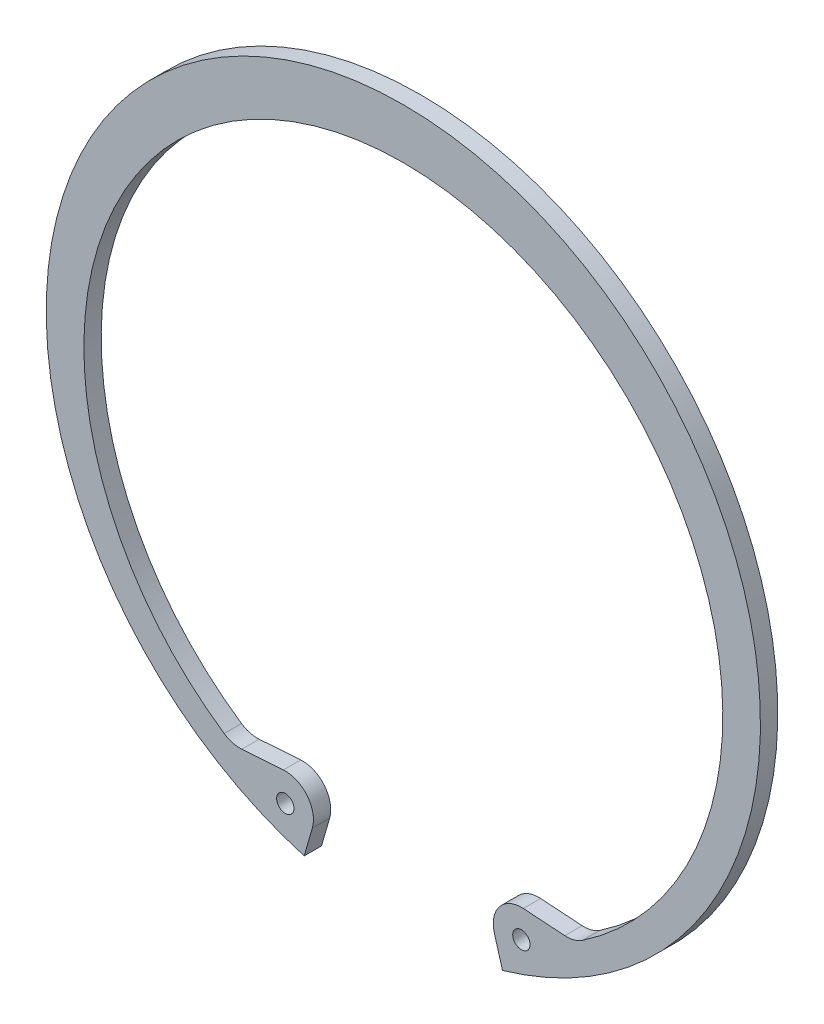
ISO-10303-21;
HEADER;
FILE_DESCRIPTION(('STEP AP214'),'2;1');
FILE_NAME('part.step','',(''),(''),'','','');
FILE_SCHEMA(('AUTOMOTIVE_DESIGN { 1 0 10303 214 1 1 1 1 }'));
ENDSEC;
DATA;
#1=APPLICATION_CONTEXT('core data for automotive mechanical design processes');
#2=APPLICATION_PROTOCOL_DEFINITION('international standard','automotive_design',2000,#1);
#3=PRODUCT_CONTEXT('',#1,'mechanical');
#4=PRODUCT('Part','Part','',(#3));
#5=PRODUCT_RELATED_PRODUCT_CATEGORY('part','',(#4));
#6=PRODUCT_DEFINITION_FORMATION('','',#4);
#7=PRODUCT_DEFINITION_CONTEXT('part definition',#1,'design');
#8=PRODUCT_DEFINITION('design','',#6,#7);
#9=PRODUCT_DEFINITION_SHAPE('','',#8);
#10=(LENGTH_UNIT() NAMED_UNIT(*) SI_UNIT(.MILLI.,.METRE.));
#11=(NAMED_UNIT(*) PLANE_ANGLE_UNIT() SI_UNIT($,.RADIAN.));
#12=(NAMED_UNIT(*) SI_UNIT($,.STERADIAN.) SOLID_ANGLE_UNIT());
#13=UNCERTAINTY_MEASURE_WITH_UNIT(LENGTH_MEASURE(1.E-05),#10,'distance_accuracy_value','');
#14=(GEOMETRIC_REPRESENTATION_CONTEXT(3) GLOBAL_UNCERTAINTY_ASSIGNED_CONTEXT((#13)) GLOBAL_UNIT_ASSIGNED_CONTEXT((#10,
#11,#12)) REPRESENTATION_CONTEXT('',''));
#15=CARTESIAN_POINT('',(0.,0.,0.));
#16=DIRECTION('',(0.,0.,1.));
#17=DIRECTION('',(1.,0.,0.));
#18=AXIS2_PLACEMENT_3D('',#15,#16,#17);
#19=CARTESIAN_POINT('',(0.,0.,4.));
#20=DIRECTION('',(0.,0.,1.));
#21=DIRECTION('',(1.,0.,0.));
#22=AXIS2_PLACEMENT_3D('',#19,#20,#21);
#23=PLANE('',#22);
#24=CARTESIAN_POINT('',(27.2700191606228,-70.939030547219,4.));
#25=DIRECTION('',(0.,0.,1.));
#26=DIRECTION('',(1.,0.,0.));
#27=AXIS2_PLACEMENT_3D('',#24,#25,#26);
#28=CIRCLE('',#27,2.);
#29=CARTESIAN_POINT('',(29.2700191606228,-70.939030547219,4.));
#30=VERTEX_POINT('',#29);
#31=EDGE_CURVE('E127',#30,#30,#28,.T.);
#32=ORIENTED_EDGE('',*,*,#31,.F.);
#33=EDGE_LOOP('',(#32));
#34=FACE_BOUND('',#33,.T.);
#35=CARTESIAN_POINT('',(0.,0.,4.));
#36=DIRECTION('',(0.,0.,1.));
#37=DIRECTION('',(1.,0.,0.));
#38=AXIS2_PLACEMENT_3D('',#35,#36,#37);
#39=CIRCLE('',#38,82.5);
#40=CARTESIAN_POINT('',(22.907802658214,-79.255804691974,4.));
#41=VERTEX_POINT('',#40);
#42=CARTESIAN_POINT('',(-22.907802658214,-79.255804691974,4.));
#43=VERTEX_POINT('',#42);
#44=EDGE_CURVE('E149',#41,#43,#39,.T.);
#45=ORIENTED_EDGE('',*,*,#44,.T.);
#46=DIRECTION('',(0.277670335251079,0.960676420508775,0.));
#47=VECTOR('',#46,1.);
#48=CARTESIAN_POINT('',(-21.0256224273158,-72.743887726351,4.));
#49=LINE('',#48,#47);
#50=CARTESIAN_POINT('',(-21.0256224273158,-72.743887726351,4.));
#51=VERTEX_POINT('',#50);
#52=EDGE_CURVE('E122',#43,#51,#49,.T.);
#53=ORIENTED_EDGE('',*,*,#52,.T.);
#54=CARTESIAN_POINT('',(-27.2700191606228,-70.939030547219,4.));
#55=DIRECTION('',(0.,0.,1.));
#56=DIRECTION('',(-1.,0.,0.));
#57=AXIS2_PLACEMENT_3D('',#54,#55,#56);
#58=CIRCLE('',#57,6.49999999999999);
#59=CARTESIAN_POINT('',(-27.709717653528,-64.4539195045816,4.));
#60=VERTEX_POINT('',#59);
#61=EDGE_CURVE('E152',#51,#60,#58,.T.);
#62=ORIENTED_EDGE('',*,*,#61,.T.);
#63=DIRECTION('',(-0.997709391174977,-0.0676459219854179,0.));
#64=VECTOR('',#63,1.);
#65=CARTESIAN_POINT('',(-37.3047397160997,-65.104473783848,4.));
#66=LINE('',#65,#64);
#67=CARTESIAN_POINT('',(-37.3047397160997,-65.104473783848,4.));
#68=VERTEX_POINT('',#67);
#69=EDGE_CURVE('E154',#60,#68,#66,.T.);
#70=ORIENTED_EDGE('',*,*,#69,.T.);
#71=CARTESIAN_POINT('',(-37.7444382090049,-58.6193627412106,4.));
#72=DIRECTION('',(0.,0.,-1.));
#73=DIRECTION('',(-1.,0.,0.));
#74=AXIS2_PLACEMENT_3D('',#71,#72,#73);
#75=CIRCLE('',#74,6.49999999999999);
#76=CARTESIAN_POINT('',(-41.3898891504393,-64.0008762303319,4.));
#77=VERTEX_POINT('',#76);
#78=EDGE_CURVE('E156',#68,#77,#75,.T.);
#79=ORIENTED_EDGE('',*,*,#78,.T.);
#80=CARTESIAN_POINT('',(0.,-2.9,4.));
#81=DIRECTION('',(0.,0.,-1.));
#82=DIRECTION('',(1.,0.,0.));
#83=AXIS2_PLACEMENT_3D('',#80,#81,#82);
#84=CIRCLE('',#83,73.8);
#85=CARTESIAN_POINT('',(41.3898891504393,-64.000876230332,4.));
#86=VERTEX_POINT('',#85);
#87=EDGE_CURVE('E158',#77,#86,#84,.T.);
#88=ORIENTED_EDGE('',*,*,#87,.T.);
#89=CARTESIAN_POINT('',(37.7444382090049,-58.6193627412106,4.));
#90=DIRECTION('',(0.,0.,-1.));
#91=DIRECTION('',(1.,0.,0.));
#92=AXIS2_PLACEMENT_3D('',#89,#90,#91);
#93=CIRCLE('',#92,6.49999999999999);
#94=CARTESIAN_POINT('',(37.3047397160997,-65.104473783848,4.));
#95=VERTEX_POINT('',#94);
#96=EDGE_CURVE('E160',#86,#95,#93,.T.);
#97=ORIENTED_EDGE('',*,*,#96,.T.);
#98=DIRECTION('',(-0.997709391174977,0.0676459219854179,0.));
#99=VECTOR('',#98,1.);
#100=CARTESIAN_POINT('',(37.3047397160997,-65.104473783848,4.));
#101=LINE('',#100,#99);
#102=CARTESIAN_POINT('',(27.709717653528,-64.4539195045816,4.));
#103=VERTEX_POINT('',#102);
#104=EDGE_CURVE('E162',#95,#103,#101,.T.);
#105=ORIENTED_EDGE('',*,*,#104,.T.);
#106=CARTESIAN_POINT('',(27.2700191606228,-70.939030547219,4.));
#107=DIRECTION('',(0.,0.,1.));
#108=DIRECTION('',(1.,0.,0.));
#109=AXIS2_PLACEMENT_3D('',#106,#107,#108);
#110=CIRCLE('',#109,6.49999999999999);
#111=CARTESIAN_POINT('',(21.0256224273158,-72.743887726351,4.));
#112=VERTEX_POINT('',#111);
#113=EDGE_CURVE('E51',#103,#112,#110,.T.);
#114=ORIENTED_EDGE('',*,*,#113,.T.);
#115=DIRECTION('',(0.277670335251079,-0.960676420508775,0.));
#116=VECTOR('',#115,1.);
#117=CARTESIAN_POINT('',(21.0256224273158,-72.743887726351,4.));
#118=LINE('',#117,#116);
#119=EDGE_CURVE('E46',#112,#41,#118,.T.);
#120=ORIENTED_EDGE('',*,*,#119,.T.);
#121=EDGE_LOOP('',(#45,#53,#62,#70,#79,#88,#97,#105,#114,#120));
#122=FACE_BOUND('',#121,.T.);
#123=CARTESIAN_POINT('',(-27.2700191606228,-70.939030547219,4.));
#124=DIRECTION('',(0.,0.,1.));
#125=DIRECTION('',(-1.,0.,0.));
#126=AXIS2_PLACEMENT_3D('',#123,#124,#125);
#127=CIRCLE('',#126,2.);
#128=CARTESIAN_POINT('',(-29.2700191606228,-70.939030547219,4.));
#129=VERTEX_POINT('',#128);
#130=EDGE_CURVE('E249',#129,#129,#127,.T.);
#131=ORIENTED_EDGE('',*,*,#130,.F.);
#132=EDGE_LOOP('',(#131));
#133=FACE_BOUND('',#132,.T.);
#134=ADVANCED_FACE('F31',(#34,#122,#133),#23,.T.);
#135=CARTESIAN_POINT('',(0.,0.,0.));
#136=DIRECTION('',(0.,0.,1.));
#137=DIRECTION('',(1.,0.,0.));
#138=AXIS2_PLACEMENT_3D('',#135,#136,#137);
#139=PLANE('',#138);
#140=CARTESIAN_POINT('',(27.2700191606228,-70.939030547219,0.));
#141=DIRECTION('',(0.,0.,1.));
#142=DIRECTION('',(1.,0.,0.));
#143=AXIS2_PLACEMENT_3D('',#140,#141,#142);
#144=CIRCLE('',#143,2.);
#145=CARTESIAN_POINT('',(29.2700191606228,-70.939030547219,0.));
#146=VERTEX_POINT('',#145);
#147=EDGE_CURVE('E130',#146,#146,#144,.T.);
#148=ORIENTED_EDGE('',*,*,#147,.T.);
#149=EDGE_LOOP('',(#148));
#150=FACE_BOUND('',#149,.T.);
#151=CARTESIAN_POINT('',(0.,0.,0.));
#152=DIRECTION('',(0.,0.,1.));
#153=DIRECTION('',(1.,0.,0.));
#154=AXIS2_PLACEMENT_3D('',#151,#152,#153);
#155=CIRCLE('',#154,82.5);
#156=CARTESIAN_POINT('',(22.907802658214,-79.255804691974,0.));
#157=VERTEX_POINT('',#156);
#158=CARTESIAN_POINT('',(-22.907802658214,-79.255804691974,0.));
#159=VERTEX_POINT('',#158);
#160=EDGE_CURVE('E113',#157,#159,#155,.T.);
#161=ORIENTED_EDGE('',*,*,#160,.F.);
#162=DIRECTION('',(0.277670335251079,-0.960676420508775,0.));
#163=VECTOR('',#162,1.);
#164=CARTESIAN_POINT('',(21.0256224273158,-72.743887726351,0.));
#165=LINE('',#164,#163);
#166=CARTESIAN_POINT('',(21.0256224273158,-72.743887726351,0.));
#167=VERTEX_POINT('',#166);
#168=EDGE_CURVE('E147',#167,#157,#165,.T.);
#169=ORIENTED_EDGE('',*,*,#168,.F.);
#170=CARTESIAN_POINT('',(27.2700191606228,-70.939030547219,0.));
#171=DIRECTION('',(0.,0.,1.));
#172=DIRECTION('',(1.,0.,0.));
#173=AXIS2_PLACEMENT_3D('',#170,#171,#172);
#174=CIRCLE('',#173,6.49999999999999);
#175=CARTESIAN_POINT('',(27.709717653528,-64.4539195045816,0.));
#176=VERTEX_POINT('',#175);
#177=EDGE_CURVE('E145',#176,#167,#174,.T.);
#178=ORIENTED_EDGE('',*,*,#177,.F.);
#179=DIRECTION('',(-0.997709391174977,0.0676459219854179,0.));
#180=VECTOR('',#179,1.);
#181=CARTESIAN_POINT('',(37.3047397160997,-65.104473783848,0.));
#182=LINE('',#181,#180);
#183=CARTESIAN_POINT('',(37.3047397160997,-65.104473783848,0.));
#184=VERTEX_POINT('',#183);
#185=EDGE_CURVE('E143',#184,#176,#182,.T.);
#186=ORIENTED_EDGE('',*,*,#185,.F.);
#187=CARTESIAN_POINT('',(37.7444382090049,-58.6193627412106,0.));
#188=DIRECTION('',(0.,0.,-1.));
#189=DIRECTION('',(1.,0.,0.));
#190=AXIS2_PLACEMENT_3D('',#187,#188,#189);
#191=CIRCLE('',#190,6.49999999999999);
#192=CARTESIAN_POINT('',(41.3898891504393,-64.000876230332,0.));
#193=VERTEX_POINT('',#192);
#194=EDGE_CURVE('E141',#193,#184,#191,.T.);
#195=ORIENTED_EDGE('',*,*,#194,.F.);
#196=CARTESIAN_POINT('',(0.,-2.9,0.));
#197=DIRECTION('',(0.,0.,-1.));
#198=DIRECTION('',(1.,0.,0.));
#199=AXIS2_PLACEMENT_3D('',#196,#197,#198);
#200=CIRCLE('',#199,73.8);
#201=CARTESIAN_POINT('',(-41.3898891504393,-64.0008762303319,0.));
#202=VERTEX_POINT('',#201);
#203=EDGE_CURVE('E139',#202,#193,#200,.T.);
#204=ORIENTED_EDGE('',*,*,#203,.F.);
#205=CARTESIAN_POINT('',(-37.7444382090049,-58.6193627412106,0.));
#206=DIRECTION('',(0.,0.,-1.));
#207=DIRECTION('',(-1.,0.,0.));
#208=AXIS2_PLACEMENT_3D('',#205,#206,#207);
#209=CIRCLE('',#208,6.49999999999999);
#210=CARTESIAN_POINT('',(-37.3047397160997,-65.104473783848,0.));
#211=VERTEX_POINT('',#210);
#212=EDGE_CURVE('E137',#211,#202,#209,.T.);
#213=ORIENTED_EDGE('',*,*,#212,.F.);
#214=DIRECTION('',(-0.997709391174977,-0.0676459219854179,0.));
#215=VECTOR('',#214,1.);
#216=CARTESIAN_POINT('',(-37.3047397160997,-65.104473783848,0.));
#217=LINE('',#216,#215);
#218=CARTESIAN_POINT('',(-27.709717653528,-64.4539195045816,0.));
#219=VERTEX_POINT('',#218);
#220=EDGE_CURVE('E135',#219,#211,#217,.T.);
#221=ORIENTED_EDGE('',*,*,#220,.F.);
#222=CARTESIAN_POINT('',(-27.2700191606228,-70.939030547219,0.));
#223=DIRECTION('',(0.,0.,1.));
#224=DIRECTION('',(-1.,0.,0.));
#225=AXIS2_PLACEMENT_3D('',#222,#223,#224);
#226=CIRCLE('',#225,6.49999999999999);
#227=CARTESIAN_POINT('',(-21.0256224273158,-72.743887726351,0.));
#228=VERTEX_POINT('',#227);
#229=EDGE_CURVE('E115',#228,#219,#226,.T.);
#230=ORIENTED_EDGE('',*,*,#229,.F.);
#231=DIRECTION('',(0.277670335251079,0.960676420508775,0.));
#232=VECTOR('',#231,1.);
#233=CARTESIAN_POINT('',(-21.0256224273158,-72.743887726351,0.));
#234=LINE('',#233,#232);
#235=EDGE_CURVE('E108',#159,#228,#234,.T.);
#236=ORIENTED_EDGE('',*,*,#235,.F.);
#237=EDGE_LOOP('',(#161,#169,#178,#186,#195,#204,#213,#221,#230,#236));
#238=FACE_BOUND('',#237,.T.);
#239=CARTESIAN_POINT('',(-27.2700191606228,-70.939030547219,0.));
#240=DIRECTION('',(0.,0.,1.));
#241=DIRECTION('',(-1.,0.,0.));
#242=AXIS2_PLACEMENT_3D('',#239,#240,#241);
#243=CIRCLE('',#242,2.);
#244=CARTESIAN_POINT('',(-29.2700191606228,-70.939030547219,0.));
#245=VERTEX_POINT('',#244);
#246=EDGE_CURVE('E252',#245,#245,#243,.T.);
#247=ORIENTED_EDGE('',*,*,#246,.T.);
#248=EDGE_LOOP('',(#247));
#249=FACE_BOUND('',#248,.T.);
#250=ADVANCED_FACE('F109',(#150,#238,#249),#139,.F.);
#251=CARTESIAN_POINT('',(0.,0.,4.));
#252=DIRECTION('',(0.,0.,-1.));
#253=DIRECTION('',(-1.,0.,0.));
#254=AXIS2_PLACEMENT_3D('',#251,#252,#253);
#255=CYLINDRICAL_SURFACE('',#254,82.5);
#256=ORIENTED_EDGE('',*,*,#160,.T.);
#257=DIRECTION('',(0.,0.,-1.));
#258=VECTOR('',#257,1.);
#259=CARTESIAN_POINT('',(-22.907802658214,-79.255804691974,4.));
#260=LINE('',#259,#258);
#261=EDGE_CURVE('E11',#43,#159,#260,.T.);
#262=ORIENTED_EDGE('',*,*,#261,.F.);
#263=ORIENTED_EDGE('',*,*,#44,.F.);
#264=DIRECTION('',(0.,0.,-1.));
#265=VECTOR('',#264,1.);
#266=CARTESIAN_POINT('',(22.907802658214,-79.255804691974,4.));
#267=LINE('',#266,#265);
#268=EDGE_CURVE('E126',#41,#157,#267,.T.);
#269=ORIENTED_EDGE('',*,*,#268,.T.);
#270=EDGE_LOOP('',(#256,#262,#263,#269));
#271=FACE_BOUND('',#270,.T.);
#272=ADVANCED_FACE('F33',(#271),#255,.T.);
#273=CARTESIAN_POINT('',(-21.0256224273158,-72.743887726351,4.));
#274=DIRECTION('',(-0.960676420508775,0.277670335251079,0.));
#275=DIRECTION('',(-0.277670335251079,-0.960676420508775,0.));
#276=AXIS2_PLACEMENT_3D('',#273,#274,#275);
#277=PLANE('',#276);
#278=ORIENTED_EDGE('',*,*,#235,.T.);
#279=DIRECTION('',(0.,0.,-1.));
#280=VECTOR('',#279,1.);
#281=CARTESIAN_POINT('',(-21.0256224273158,-72.743887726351,4.));
#282=LINE('',#281,#280);
#283=EDGE_CURVE('E39',#51,#228,#282,.T.);
#284=ORIENTED_EDGE('',*,*,#283,.F.);
#285=ORIENTED_EDGE('',*,*,#52,.F.);
#286=ORIENTED_EDGE('',*,*,#261,.T.);
#287=EDGE_LOOP('',(#278,#284,#285,#286));
#288=FACE_BOUND('',#287,.T.);
#289=ADVANCED_FACE('F121',(#288),#277,.F.);
#290=CARTESIAN_POINT('',(-27.2700191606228,-70.939030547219,4.));
#291=DIRECTION('',(0.,0.,-1.));
#292=DIRECTION('',(-1.,0.,0.));
#293=AXIS2_PLACEMENT_3D('',#290,#291,#292);
#294=CYLINDRICAL_SURFACE('',#293,6.49999999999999);
#295=ORIENTED_EDGE('',*,*,#229,.T.);
#296=DIRECTION('',(0.,0.,-1.));
#297=VECTOR('',#296,1.);
#298=CARTESIAN_POINT('',(-27.709717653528,-64.4539195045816,4.));
#299=LINE('',#298,#297);
#300=EDGE_CURVE('E185',#60,#219,#299,.T.);
#301=ORIENTED_EDGE('',*,*,#300,.F.);
#302=ORIENTED_EDGE('',*,*,#61,.F.);
#303=ORIENTED_EDGE('',*,*,#283,.T.);
#304=EDGE_LOOP('',(#295,#301,#302,#303));
#305=FACE_BOUND('',#304,.T.);
#306=ADVANCED_FACE('F189',(#305),#294,.T.);
#307=CARTESIAN_POINT('',(-37.3047397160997,-65.104473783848,4.));
#308=DIRECTION('',(0.0676459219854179,-0.997709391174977,0.));
#309=DIRECTION('',(0.997709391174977,0.0676459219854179,0.));
#310=AXIS2_PLACEMENT_3D('',#307,#308,#309);
#311=PLANE('',#310);
#312=ORIENTED_EDGE('',*,*,#220,.T.);
#313=DIRECTION('',(0.,0.,-1.));
#314=VECTOR('',#313,1.);
#315=CARTESIAN_POINT('',(-37.3047397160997,-65.104473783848,4.));
#316=LINE('',#315,#314);
#317=EDGE_CURVE('E182',#68,#211,#316,.T.);
#318=ORIENTED_EDGE('',*,*,#317,.F.);
#319=ORIENTED_EDGE('',*,*,#69,.F.);
#320=ORIENTED_EDGE('',*,*,#300,.T.);
#321=EDGE_LOOP('',(#312,#318,#319,#320));
#322=FACE_BOUND('',#321,.T.);
#323=ADVANCED_FACE('F197',(#322),#311,.F.);
#324=CARTESIAN_POINT('',(-37.7444382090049,-58.6193627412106,4.));
#325=DIRECTION('',(0.,0.,-1.));
#326=DIRECTION('',(-1.,0.,0.));
#327=AXIS2_PLACEMENT_3D('',#324,#325,#326);
#328=CYLINDRICAL_SURFACE('',#327,6.49999999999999);
#329=ORIENTED_EDGE('',*,*,#212,.T.);
#330=DIRECTION('',(0.,0.,-1.));
#331=VECTOR('',#330,1.);
#332=CARTESIAN_POINT('',(-41.3898891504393,-64.0008762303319,4.));
#333=LINE('',#332,#331);
#334=EDGE_CURVE('E179',#77,#202,#333,.T.);
#335=ORIENTED_EDGE('',*,*,#334,.F.);
#336=ORIENTED_EDGE('',*,*,#78,.F.);
#337=ORIENTED_EDGE('',*,*,#317,.T.);
#338=EDGE_LOOP('',(#329,#335,#336,#337));
#339=FACE_BOUND('',#338,.T.);
#340=ADVANCED_FACE('F200',(#339),#328,.F.);
#341=CARTESIAN_POINT('',(0.,-2.9,4.));
#342=DIRECTION('',(0.,0.,-1.));
#343=DIRECTION('',(-1.,0.,0.));
#344=AXIS2_PLACEMENT_3D('',#341,#342,#343);
#345=CYLINDRICAL_SURFACE('',#344,73.8);
#346=ORIENTED_EDGE('',*,*,#203,.T.);
#347=DIRECTION('',(0.,0.,-1.));
#348=VECTOR('',#347,1.);
#349=CARTESIAN_POINT('',(41.3898891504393,-64.000876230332,4.));
#350=LINE('',#349,#348);
#351=EDGE_CURVE('E176',#86,#193,#350,.T.);
#352=ORIENTED_EDGE('',*,*,#351,.F.);
#353=ORIENTED_EDGE('',*,*,#87,.F.);
#354=ORIENTED_EDGE('',*,*,#334,.T.);
#355=EDGE_LOOP('',(#346,#352,#353,#354));
#356=FACE_BOUND('',#355,.T.);
#357=ADVANCED_FACE('F205',(#356),#345,.F.);
#358=CARTESIAN_POINT('',(37.7444382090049,-58.6193627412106,4.));
#359=DIRECTION('',(0.,0.,-1.));
#360=DIRECTION('',(-1.,0.,0.));
#361=AXIS2_PLACEMENT_3D('',#358,#359,#360);
#362=CYLINDRICAL_SURFACE('',#361,6.49999999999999);
#363=ORIENTED_EDGE('',*,*,#194,.T.);
#364=DIRECTION('',(0.,0.,-1.));
#365=VECTOR('',#364,1.);
#366=CARTESIAN_POINT('',(37.3047397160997,-65.104473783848,4.));
#367=LINE('',#366,#365);
#368=EDGE_CURVE('E173',#95,#184,#367,.T.);
#369=ORIENTED_EDGE('',*,*,#368,.F.);
#370=ORIENTED_EDGE('',*,*,#96,.F.);
#371=ORIENTED_EDGE('',*,*,#351,.T.);
#372=EDGE_LOOP('',(#363,#369,#370,#371));
#373=FACE_BOUND('',#372,.T.);
#374=ADVANCED_FACE('F211',(#373),#362,.F.);
#375=CARTESIAN_POINT('',(37.3047397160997,-65.104473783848,4.));
#376=DIRECTION('',(-0.0676459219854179,-0.997709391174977,0.));
#377=DIRECTION('',(0.997709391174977,-0.0676459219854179,0.));
#378=AXIS2_PLACEMENT_3D('',#375,#376,#377);
#379=PLANE('',#378);
#380=ORIENTED_EDGE('',*,*,#185,.T.);
#381=DIRECTION('',(0.,0.,-1.));
#382=VECTOR('',#381,1.);
#383=CARTESIAN_POINT('',(27.709717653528,-64.4539195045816,4.));
#384=LINE('',#383,#382);
#385=EDGE_CURVE('E170',#103,#176,#384,.T.);
#386=ORIENTED_EDGE('',*,*,#385,.F.);
#387=ORIENTED_EDGE('',*,*,#104,.F.);
#388=ORIENTED_EDGE('',*,*,#368,.T.);
#389=EDGE_LOOP('',(#380,#386,#387,#388));
#390=FACE_BOUND('',#389,.T.);
#391=ADVANCED_FACE('F215',(#390),#379,.F.);
#392=CARTESIAN_POINT('',(27.2700191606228,-70.939030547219,4.));
#393=DIRECTION('',(0.,0.,-1.));
#394=DIRECTION('',(-1.,0.,0.));
#395=AXIS2_PLACEMENT_3D('',#392,#393,#394);
#396=CYLINDRICAL_SURFACE('',#395,6.49999999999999);
#397=ORIENTED_EDGE('',*,*,#177,.T.);
#398=DIRECTION('',(0.,0.,-1.));
#399=VECTOR('',#398,1.);
#400=CARTESIAN_POINT('',(21.0256224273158,-72.743887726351,4.));
#401=LINE('',#400,#399);
#402=EDGE_CURVE('E167',#112,#167,#401,.T.);
#403=ORIENTED_EDGE('',*,*,#402,.F.);
#404=ORIENTED_EDGE('',*,*,#113,.F.);
#405=ORIENTED_EDGE('',*,*,#385,.T.);
#406=EDGE_LOOP('',(#397,#403,#404,#405));
#407=FACE_BOUND('',#406,.T.);
#408=ADVANCED_FACE('F218',(#407),#396,.T.);
#409=CARTESIAN_POINT('',(21.0256224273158,-72.743887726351,4.));
#410=DIRECTION('',(0.960676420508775,0.277670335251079,0.));
#411=DIRECTION('',(-0.277670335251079,0.960676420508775,0.));
#412=AXIS2_PLACEMENT_3D('',#409,#410,#411);
#413=PLANE('',#412);
#414=ORIENTED_EDGE('',*,*,#168,.T.);
#415=ORIENTED_EDGE('',*,*,#268,.F.);
#416=ORIENTED_EDGE('',*,*,#119,.F.);
#417=ORIENTED_EDGE('',*,*,#402,.T.);
#418=EDGE_LOOP('',(#414,#415,#416,#417));
#419=FACE_BOUND('',#418,.T.);
#420=ADVANCED_FACE('F220',(#419),#413,.F.);
#421=CARTESIAN_POINT('',(27.2700191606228,-70.939030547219,4.));
#422=DIRECTION('',(0.,0.,-1.));
#423=DIRECTION('',(-1.,0.,0.));
#424=AXIS2_PLACEMENT_3D('',#421,#422,#423);
#425=CYLINDRICAL_SURFACE('',#424,2.);
#426=ORIENTED_EDGE('',*,*,#31,.T.);
#427=EDGE_LOOP('',(#426));
#428=FACE_BOUND('',#427,.T.);
#429=ORIENTED_EDGE('',*,*,#147,.F.);
#430=EDGE_LOOP('',(#429));
#431=FACE_BOUND('',#430,.T.);
#432=ADVANCED_FACE('F222',(#428,#431),#425,.F.);
#433=CARTESIAN_POINT('',(-27.2700191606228,-70.939030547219,4.));
#434=DIRECTION('',(0.,0.,-1.));
#435=DIRECTION('',(-1.,0.,0.));
#436=AXIS2_PLACEMENT_3D('',#433,#434,#435);
#437=CYLINDRICAL_SURFACE('',#436,2.);
#438=ORIENTED_EDGE('',*,*,#130,.T.);
#439=EDGE_LOOP('',(#438));
#440=FACE_BOUND('',#439,.T.);
#441=ORIENTED_EDGE('',*,*,#246,.F.);
#442=EDGE_LOOP('',(#441));
#443=FACE_BOUND('',#442,.T.);
#444=ADVANCED_FACE('F228',(#440,#443),#437,.F.);
#445=CLOSED_SHELL('',(#134,#250,#272,#289,#306,#323,#340,#357,#374,#391,#408,#420,#432,#444));
#446=MANIFOLD_SOLID_BREP('B2',#445);
#447=ADVANCED_BREP_SHAPE_REPRESENTATION('',(#18,#446),#14);
#448=SHAPE_DEFINITION_REPRESENTATION(#9,#447);
ENDSEC;
END-ISO-10303-21;
